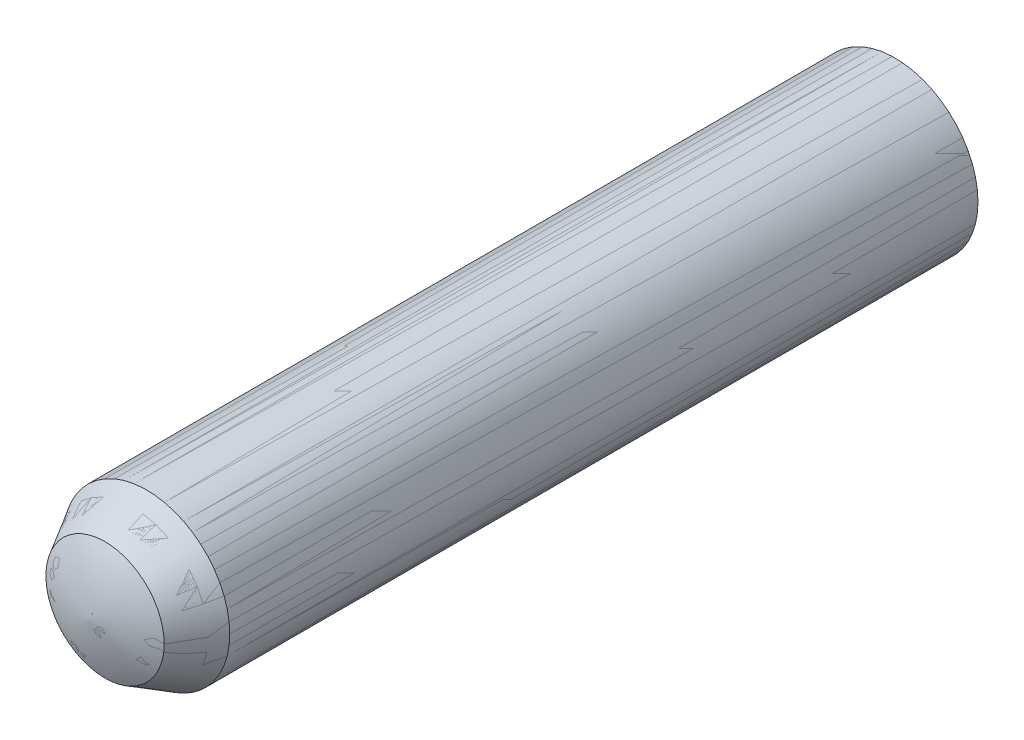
ISO-10303-21;
HEADER;
FILE_DESCRIPTION(('STEP AP214'),'2;1');
FILE_NAME('part.step','',(''),(''),'','','');
FILE_SCHEMA(('AUTOMOTIVE_DESIGN { 1 0 10303 214 1 1 1 1 }'));
ENDSEC;
DATA;
#1=APPLICATION_CONTEXT('core data for automotive mechanical design processes');
#2=APPLICATION_PROTOCOL_DEFINITION('international standard','automotive_design',2000,#1);
#3=PRODUCT_CONTEXT('',#1,'mechanical');
#4=PRODUCT('Part','Part','',(#3));
#5=PRODUCT_RELATED_PRODUCT_CATEGORY('part','',(#4));
#6=PRODUCT_DEFINITION_FORMATION('','',#4);
#7=PRODUCT_DEFINITION_CONTEXT('part definition',#1,'design');
#8=PRODUCT_DEFINITION('design','',#6,#7);
#9=PRODUCT_DEFINITION_SHAPE('','',#8);
#10=(LENGTH_UNIT() NAMED_UNIT(*) SI_UNIT(.MILLI.,.METRE.));
#11=(NAMED_UNIT(*) PLANE_ANGLE_UNIT() SI_UNIT($,.RADIAN.));
#12=(NAMED_UNIT(*) SI_UNIT($,.STERADIAN.) SOLID_ANGLE_UNIT());
#13=UNCERTAINTY_MEASURE_WITH_UNIT(LENGTH_MEASURE(1.E-05),#10,'distance_accuracy_value','');
#14=(GEOMETRIC_REPRESENTATION_CONTEXT(3) GLOBAL_UNCERTAINTY_ASSIGNED_CONTEXT((#13)) GLOBAL_UNIT_ASSIGNED_CONTEXT((#10,
#11,#12)) REPRESENTATION_CONTEXT('',''));
#15=CARTESIAN_POINT('',(0.,0.,0.));
#16=DIRECTION('',(0.,0.,1.));
#17=DIRECTION('',(1.,0.,0.));
#18=AXIS2_PLACEMENT_3D('',#15,#16,#17);
#19=CARTESIAN_POINT('',(-0.109549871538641,-1.30329266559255E-13,3.99849957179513));
#20=DIRECTION('',(0.,-0.999999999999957,0.));
#21=DIRECTION('',(0.99999999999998,0.,0.));
#22=AXIS2_PLACEMENT_3D('',#19,#20,#21);
#23=CIRCLE('',#22,4.);
#24=TRIMMED_CURVE('',#23,(PARAMETER_VALUE(-1.5434054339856)),(PARAMETER_VALUE(1.5434054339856)),
.T.,.PARAMETER.);
#25=CARTESIAN_POINT('',(-1.02348685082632E-13,-1.30104260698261E-13,3.99849957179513));
#26=DIRECTION('',(0.,0.,0.999999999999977));
#27=AXIS1_PLACEMENT('',#25,#26);
#28=SURFACE_OF_REVOLUTION('',#24,#27);
#29=CARTESIAN_POINT('',(-1.00613961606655E-13,-1.30104260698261E-13,0.600000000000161));
#30=DIRECTION('',(0.,0.,0.999999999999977));
#31=DIRECTION('',(0.99999999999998,0.,0.));
#32=AXIS2_PLACEMENT_3D('',#29,#30,#31);
#33=CIRCLE('',#32,2.);
#34=CARTESIAN_POINT('',(1.99999999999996,0.,0.600000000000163));
#35=VERTEX_POINT('',#34);
#36=EDGE_CURVE('P0_E13',#35,#35,#33,.T.);
#37=ORIENTED_EDGE('',*,*,#36,.F.);
#38=EDGE_LOOP('',(#37));
#39=FACE_BOUND('',#38,.T.);
#40=CARTESIAN_POINT('',(0.,0.,1.61329283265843E-13));
#41=VERTEX_POINT('',#40);
#42=VERTEX_LOOP('',#41);
#43=FACE_BOUND('',#42,.T.);
#44=ADVANCED_FACE('P0_F358',(#39,#43),#28,.T.);
#45=CARTESIAN_POINT('',(0.,0.,1.61329283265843E-13));
#46=DIRECTION('',(0.,0.,0.999999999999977));
#47=DIRECTION('',(0.99999999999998,0.,0.));
#48=AXIS2_PLACEMENT_3D('',#45,#46,#47);
#49=CYLINDRICAL_SURFACE('',#48,2.);
#50=CARTESIAN_POINT('',(-1.05818132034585E-13,0.,18.6));
#51=DIRECTION('',(0.,0.,0.999999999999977));
#52=DIRECTION('',(0.99999999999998,0.,0.));
#53=AXIS2_PLACEMENT_3D('',#50,#51,#52);
#54=CIRCLE('',#53,2.);
#55=CARTESIAN_POINT('',(1.99999999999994,0.,18.6));
#56=VERTEX_POINT('',#55);
#57=EDGE_CURVE('P0_E365',#56,#56,#54,.T.);
#58=CARTESIAN_POINT('',(1.99999999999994,0.,18.6));
#59=CARTESIAN_POINT('',(1.99999999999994,0.,18.4125));
#60=CARTESIAN_POINT('',(1.99999999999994,0.,18.225));
#61=CARTESIAN_POINT('',(1.99999999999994,0.,17.85));
#62=CARTESIAN_POINT('',(1.99999999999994,0.,17.6625));
#63=CARTESIAN_POINT('',(1.99999999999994,0.,17.2875));
#64=CARTESIAN_POINT('',(1.99999999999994,0.,17.1));
#65=CARTESIAN_POINT('',(1.99999999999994,0.,16.725));
#66=CARTESIAN_POINT('',(1.99999999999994,0.,16.5375));
#67=CARTESIAN_POINT('',(1.99999999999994,0.,16.1625));
#68=CARTESIAN_POINT('',(1.99999999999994,0.,15.975));
#69=CARTESIAN_POINT('',(1.99999999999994,0.,15.6));
#70=CARTESIAN_POINT('',(1.99999999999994,0.,15.4125));
#71=CARTESIAN_POINT('',(1.99999999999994,0.,15.0375));
#72=CARTESIAN_POINT('',(1.99999999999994,0.,14.85));
#73=CARTESIAN_POINT('',(1.99999999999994,0.,14.475));
#74=CARTESIAN_POINT('',(1.99999999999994,0.,14.2875));
#75=CARTESIAN_POINT('',(1.99999999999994,0.,13.9125));
#76=CARTESIAN_POINT('',(1.99999999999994,0.,13.725));
#77=CARTESIAN_POINT('',(1.99999999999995,0.,13.35));
#78=CARTESIAN_POINT('',(1.99999999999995,0.,13.1625));
#79=CARTESIAN_POINT('',(1.99999999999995,0.,12.7875));
#80=CARTESIAN_POINT('',(1.99999999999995,0.,12.6));
#81=CARTESIAN_POINT('',(1.99999999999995,0.,12.225));
#82=CARTESIAN_POINT('',(1.99999999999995,0.,12.0375));
#83=CARTESIAN_POINT('',(1.99999999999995,0.,11.6625000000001));
#84=CARTESIAN_POINT('',(1.99999999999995,0.,11.4750000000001));
#85=CARTESIAN_POINT('',(1.99999999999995,0.,11.1000000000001));
#86=CARTESIAN_POINT('',(1.99999999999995,0.,10.9125000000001));
#87=CARTESIAN_POINT('',(1.99999999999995,0.,10.5375000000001));
#88=CARTESIAN_POINT('',(1.99999999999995,0.,10.3500000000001));
#89=CARTESIAN_POINT('',(1.99999999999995,0.,9.97500000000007));
#90=CARTESIAN_POINT('',(1.99999999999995,0.,9.78750000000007));
#91=CARTESIAN_POINT('',(1.99999999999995,0.,9.41250000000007));
#92=CARTESIAN_POINT('',(1.99999999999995,0.,9.22500000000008));
#93=CARTESIAN_POINT('',(1.99999999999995,0.,8.85000000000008));
#94=CARTESIAN_POINT('',(1.99999999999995,0.,8.66250000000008));
#95=CARTESIAN_POINT('',(1.99999999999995,0.,8.28750000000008));
#96=CARTESIAN_POINT('',(1.99999999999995,0.,8.10000000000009));
#97=CARTESIAN_POINT('',(1.99999999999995,0.,7.72500000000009));
#98=CARTESIAN_POINT('',(1.99999999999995,0.,7.53750000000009));
#99=CARTESIAN_POINT('',(1.99999999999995,0.,7.1625000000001));
#100=CARTESIAN_POINT('',(1.99999999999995,0.,6.9750000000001));
#101=CARTESIAN_POINT('',(1.99999999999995,0.,6.6000000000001));
#102=CARTESIAN_POINT('',(1.99999999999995,0.,6.41250000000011));
#103=CARTESIAN_POINT('',(1.99999999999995,0.,6.03750000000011));
#104=CARTESIAN_POINT('',(1.99999999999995,0.,5.85000000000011));
#105=CARTESIAN_POINT('',(1.99999999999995,0.,5.47500000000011));
#106=CARTESIAN_POINT('',(1.99999999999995,0.,5.28750000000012));
#107=CARTESIAN_POINT('',(1.99999999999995,0.,4.91250000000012));
#108=CARTESIAN_POINT('',(1.99999999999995,0.,4.72500000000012));
#109=CARTESIAN_POINT('',(1.99999999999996,0.,4.35000000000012));
#110=CARTESIAN_POINT('',(1.99999999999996,0.,4.16250000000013));
#111=CARTESIAN_POINT('',(1.99999999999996,0.,3.78750000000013));
#112=CARTESIAN_POINT('',(1.99999999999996,0.,3.60000000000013));
#113=CARTESIAN_POINT('',(1.99999999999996,0.,3.22500000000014));
#114=CARTESIAN_POINT('',(1.99999999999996,0.,3.03750000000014));
#115=CARTESIAN_POINT('',(1.99999999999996,0.,2.66250000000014));
#116=CARTESIAN_POINT('',(1.99999999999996,0.,2.47500000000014));
#117=CARTESIAN_POINT('',(1.99999999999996,0.,2.10000000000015));
#118=CARTESIAN_POINT('',(1.99999999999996,0.,1.91250000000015));
#119=CARTESIAN_POINT('',(1.99999999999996,0.,1.53750000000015));
#120=CARTESIAN_POINT('',(1.99999999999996,0.,1.35000000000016));
#121=CARTESIAN_POINT('',(1.99999999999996,0.,0.975000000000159));
#122=CARTESIAN_POINT('',(1.99999999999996,0.,0.787500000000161));
#123=CARTESIAN_POINT('',(1.99999999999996,0.,0.600000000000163));
#124=B_SPLINE_CURVE_WITH_KNOTS('',3,(#58,#59,#60,#61,#62,#63,#64,#65,#66,#67,#68,#69,#70,#71,
#72,#73,#74,#75,#76,#77,#78,#79,#80,#81,#82,#83,#84,#85,#86,#87,#88,#89,#90,#91,#92,#93,#94,#95,
#96,#97,#98,#99,#100,#101,#102,#103,#104,#105,#106,#107,#108,#109,#110,#111,#112,#113,#114,#115,
#116,#117,#118,#119,#120,#121,#122,#123),.UNSPECIFIED.,.F.,.F.,(4,2,2,2,2,2,2,2,2,2,2,2,2,2,2,2,
2,2,2,2,2,2,2,2,2,2,2,2,2,2,2,2,4),(0.,0.562499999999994,1.12499999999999,1.68749999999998,
2.24999999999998,2.81249999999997,3.37499999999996,3.93749999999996,4.49999999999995,
5.06249999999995,5.62499999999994,6.18749999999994,6.74999999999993,7.31249999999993,
7.87499999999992,8.43749999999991,8.99999999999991,9.5624999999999,10.1249999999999,
10.6874999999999,11.2499999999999,11.8124999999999,12.3749999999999,12.9374999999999,
13.4999999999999,14.0624999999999,14.6249999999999,15.1874999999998,15.7499999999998,
16.3124999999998,16.8749999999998,17.4374999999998,17.9999999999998),.UNSPECIFIED.);
#125=EDGE_CURVE('P0_BSEAM385',#56,#35,#124,.T.);
#126=ORIENTED_EDGE('',*,*,#57,.F.);
#127=ORIENTED_EDGE('',*,*,#36,.T.);
#128=ORIENTED_EDGE('',*,*,#125,.T.);
#129=ORIENTED_EDGE('',*,*,#125,.F.);
#130=EDGE_LOOP('',(#126,#128,#127,#129));
#131=FACE_BOUND('',#130,.T.);
#132=ADVANCED_FACE('P0_F385',(#131),#49,.T.);
#133=CARTESIAN_POINT('',(-1.05818132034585E-13,0.,18.6));
#134=DIRECTION('',(0.,0.,-0.999999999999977));
#135=DIRECTION('',(-0.99999999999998,0.,0.));
#136=AXIS2_PLACEMENT_3D('',#133,#134,#135);
#137=CONICAL_SURFACE('',#136,2.,0.523598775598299);
#138=CARTESIAN_POINT('',(0.,-1.57859836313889E-13,19.6));
#139=DIRECTION('',(0.,0.,0.999999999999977));
#140=DIRECTION('',(0.99999999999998,0.,0.));
#141=AXIS2_PLACEMENT_3D('',#138,#139,#140);
#142=CIRCLE('',#141,1.42264973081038);
#143=CARTESIAN_POINT('',(1.42264973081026,-1.54937838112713E-13,19.6));
#144=VERTEX_POINT('',#143);
#145=EDGE_CURVE('P0_E378',#144,#144,#142,.T.);
#146=ORIENTED_EDGE('',*,*,#145,.F.);
#147=EDGE_LOOP('',(#146));
#148=FACE_BOUND('',#147,.T.);
#149=ORIENTED_EDGE('',*,*,#57,.T.);
#150=EDGE_LOOP('',(#149));
#151=FACE_BOUND('',#150,.T.);
#152=ADVANCED_FACE('P0_F374',(#148,#151),#137,.T.);
#153=CARTESIAN_POINT('',(-0.352722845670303,0.,16.0155820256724));
#154=DIRECTION('',(0.,-0.999999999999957,0.));
#155=DIRECTION('',(0.99999999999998,0.,0.));
#156=AXIS2_PLACEMENT_3D('',#153,#154,#155);
#157=CIRCLE('',#156,4.);
#158=TRIMMED_CURVE('',#157,(PARAMETER_VALUE(-1.48250093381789)),
(PARAMETER_VALUE(1.48250093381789)),.T.,.PARAMETER.);
#159=CARTESIAN_POINT('',(0.,0.,16.0155820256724));
#160=DIRECTION('',(0.,0.,0.999999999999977));
#161=AXIS1_PLACEMENT('',#159,#160);
#162=SURFACE_OF_REVOLUTION('',#158,#161);
#163=CARTESIAN_POINT('',(0.,-1.6826817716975E-13,19.9999999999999));
#164=VERTEX_POINT('',#163);
#165=VERTEX_LOOP('',#164);
#166=FACE_BOUND('',#165,.T.);
#167=ORIENTED_EDGE('',*,*,#145,.T.);
#168=EDGE_LOOP('',(#167));
#169=FACE_BOUND('',#168,.T.);
#170=ADVANCED_FACE('P0_F371',(#166,#169),#162,.T.);
#171=CLOSED_SHELL('',(#44,#132,#152,#170));
#172=MANIFOLD_SOLID_BREP('P0_B2',#171);
#173=CARTESIAN_POINT('',(-0.109549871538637,-1.05872388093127E-13,3.99849957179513));
#174=DIRECTION('',(0.,-0.99999999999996,0.));
#175=DIRECTION('',(0.99999999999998,0.,0.));
#176=AXIS2_PLACEMENT_3D('',#173,#174,#175);
#177=CIRCLE('',#176,4.);
#178=TRIMMED_CURVE('',#177,(PARAMETER_VALUE(-1.5434054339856)),
(PARAMETER_VALUE(1.5434054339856)),.T.,.PARAMETER.);
#179=CARTESIAN_POINT('',(0.,-1.05818132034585E-13,3.99849957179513));
#180=DIRECTION('',(0.,0.,0.99999999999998));
#181=AXIS1_PLACEMENT('',#179,#180);
#182=SURFACE_OF_REVOLUTION('',#178,#181);
#183=CARTESIAN_POINT('',(0.,-1.05818132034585E-13,0.600000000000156));
#184=DIRECTION('',(0.,0.,0.99999999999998));
#185=DIRECTION('',(0.99999999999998,0.,0.));
#186=AXIS2_PLACEMENT_3D('',#183,#184,#185);
#187=CIRCLE('',#186,2.);
#188=CARTESIAN_POINT('',(1.99999999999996,0.,0.600000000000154));
#189=VERTEX_POINT('',#188);
#190=EDGE_CURVE('P1_E10',#189,#189,#187,.T.);
#191=ORIENTED_EDGE('',*,*,#190,.F.);
#192=EDGE_LOOP('',(#191));
#193=FACE_BOUND('',#192,.T.);
#194=CARTESIAN_POINT('',(0.,0.,1.57859836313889E-13));
#195=VERTEX_POINT('',#194);
#196=VERTEX_LOOP('',#195);
#197=FACE_BOUND('',#196,.T.);
#198=ADVANCED_FACE('P1_F15',(#193,#197),#182,.T.);
#199=CARTESIAN_POINT('',(0.,0.,1.57859836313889E-13));
#200=DIRECTION('',(0.,0.,0.99999999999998));
#201=DIRECTION('',(0.99999999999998,0.,0.));
#202=AXIS2_PLACEMENT_3D('',#199,#200,#201);
#203=CYLINDRICAL_SURFACE('',#202,2.);
#204=CARTESIAN_POINT('',(0.,0.,18.6));
#205=DIRECTION('',(0.,0.,0.99999999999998));
#206=DIRECTION('',(0.99999999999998,0.,0.));
#207=AXIS2_PLACEMENT_3D('',#204,#205,#206);
#208=CIRCLE('',#207,2.);
#209=CARTESIAN_POINT('',(1.99999999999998,0.,18.6));
#210=VERTEX_POINT('',#209);
#211=EDGE_CURVE('P1_E22',#210,#210,#208,.T.);
#212=CARTESIAN_POINT('',(1.99999999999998,0.,18.6));
#213=CARTESIAN_POINT('',(1.99999999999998,0.,18.4125));
#214=CARTESIAN_POINT('',(1.99999999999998,0.,18.225));
#215=CARTESIAN_POINT('',(1.99999999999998,0.,17.85));
#216=CARTESIAN_POINT('',(1.99999999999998,0.,17.6625));
#217=CARTESIAN_POINT('',(1.99999999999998,0.,17.2875));
#218=CARTESIAN_POINT('',(1.99999999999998,0.,17.1));
#219=CARTESIAN_POINT('',(1.99999999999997,0.,16.725));
#220=CARTESIAN_POINT('',(1.99999999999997,0.,16.5375));
#221=CARTESIAN_POINT('',(1.99999999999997,0.,16.1625));
#222=CARTESIAN_POINT('',(1.99999999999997,0.,15.975));
#223=CARTESIAN_POINT('',(1.99999999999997,0.,15.6));
#224=CARTESIAN_POINT('',(1.99999999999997,0.,15.4125));
#225=CARTESIAN_POINT('',(1.99999999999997,0.,15.0375));
#226=CARTESIAN_POINT('',(1.99999999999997,0.,14.85));
#227=CARTESIAN_POINT('',(1.99999999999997,0.,14.475));
#228=CARTESIAN_POINT('',(1.99999999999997,0.,14.2875));
#229=CARTESIAN_POINT('',(1.99999999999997,0.,13.9125));
#230=CARTESIAN_POINT('',(1.99999999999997,0.,13.725));
#231=CARTESIAN_POINT('',(1.99999999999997,0.,13.35));
#232=CARTESIAN_POINT('',(1.99999999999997,0.,13.1625));
#233=CARTESIAN_POINT('',(1.99999999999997,0.,12.7875000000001));
#234=CARTESIAN_POINT('',(1.99999999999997,0.,12.6000000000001));
#235=CARTESIAN_POINT('',(1.99999999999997,0.,12.2250000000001));
#236=CARTESIAN_POINT('',(1.99999999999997,0.,12.0375000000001));
#237=CARTESIAN_POINT('',(1.99999999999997,0.,11.6625000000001));
#238=CARTESIAN_POINT('',(1.99999999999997,0.,11.4750000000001));
#239=CARTESIAN_POINT('',(1.99999999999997,0.,11.1000000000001));
#240=CARTESIAN_POINT('',(1.99999999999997,0.,10.9125000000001));
#241=CARTESIAN_POINT('',(1.99999999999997,0.,10.5375000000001));
#242=CARTESIAN_POINT('',(1.99999999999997,0.,10.3500000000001));
#243=CARTESIAN_POINT('',(1.99999999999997,0.,9.97500000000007));
#244=CARTESIAN_POINT('',(1.99999999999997,0.,9.78750000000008));
#245=CARTESIAN_POINT('',(1.99999999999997,0.,9.41250000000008));
#246=CARTESIAN_POINT('',(1.99999999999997,0.,9.22500000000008));
#247=CARTESIAN_POINT('',(1.99999999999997,0.,8.85000000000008));
#248=CARTESIAN_POINT('',(1.99999999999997,0.,8.66250000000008));
#249=CARTESIAN_POINT('',(1.99999999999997,0.,8.28750000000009));
#250=CARTESIAN_POINT('',(1.99999999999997,0.,8.10000000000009));
#251=CARTESIAN_POINT('',(1.99999999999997,0.,7.72500000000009));
#252=CARTESIAN_POINT('',(1.99999999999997,0.,7.53750000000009));
#253=CARTESIAN_POINT('',(1.99999999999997,0.,7.1625000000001));
#254=CARTESIAN_POINT('',(1.99999999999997,0.,6.9750000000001));
#255=CARTESIAN_POINT('',(1.99999999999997,0.,6.6000000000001));
#256=CARTESIAN_POINT('',(1.99999999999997,0.,6.4125000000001));
#257=CARTESIAN_POINT('',(1.99999999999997,0.,6.03750000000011));
#258=CARTESIAN_POINT('',(1.99999999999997,0.,5.85000000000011));
#259=CARTESIAN_POINT('',(1.99999999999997,0.,5.47500000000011));
#260=CARTESIAN_POINT('',(1.99999999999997,0.,5.28750000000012));
#261=CARTESIAN_POINT('',(1.99999999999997,0.,4.91250000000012));
#262=CARTESIAN_POINT('',(1.99999999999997,0.,4.72500000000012));
#263=CARTESIAN_POINT('',(1.99999999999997,0.,4.35000000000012));
#264=CARTESIAN_POINT('',(1.99999999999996,0.,4.16250000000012));
#265=CARTESIAN_POINT('',(1.99999999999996,0.,3.78750000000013));
#266=CARTESIAN_POINT('',(1.99999999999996,0.,3.60000000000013));
#267=CARTESIAN_POINT('',(1.99999999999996,0.,3.22500000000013));
#268=CARTESIAN_POINT('',(1.99999999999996,0.,3.03750000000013));
#269=CARTESIAN_POINT('',(1.99999999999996,0.,2.66250000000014));
#270=CARTESIAN_POINT('',(1.99999999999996,0.,2.47500000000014));
#271=CARTESIAN_POINT('',(1.99999999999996,0.,2.10000000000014));
#272=CARTESIAN_POINT('',(1.99999999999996,0.,1.91250000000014));
#273=CARTESIAN_POINT('',(1.99999999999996,0.,1.53750000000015));
#274=CARTESIAN_POINT('',(1.99999999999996,0.,1.35000000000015));
#275=CARTESIAN_POINT('',(1.99999999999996,0.,0.975000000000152));
#276=CARTESIAN_POINT('',(1.99999999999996,0.,0.787500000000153));
#277=CARTESIAN_POINT('',(1.99999999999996,0.,0.600000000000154));
#278=B_SPLINE_CURVE_WITH_KNOTS('',3,(#212,#213,#214,#215,#216,#217,#218,#219,#220,#221,#222,
#223,#224,#225,#226,#227,#228,#229,#230,#231,#232,#233,#234,#235,#236,#237,#238,#239,#240,#241,
#242,#243,#244,#245,#246,#247,#248,#249,#250,#251,#252,#253,#254,#255,#256,#257,#258,#259,#260,
#261,#262,#263,#264,#265,#266,#267,#268,#269,#270,#271,#272,#273,#274,#275,#276,#277),
.UNSPECIFIED.,.F.,.F.,(4,2,2,2,2,2,2,2,2,2,2,2,2,2,2,2,2,2,2,2,2,2,2,2,2,2,2,2,2,2,2,2,4),(0.,
0.562499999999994,1.12499999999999,1.68749999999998,2.24999999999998,2.81249999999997,
3.37499999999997,3.93749999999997,4.49999999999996,5.06249999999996,5.62499999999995,
6.18749999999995,6.74999999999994,7.31249999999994,7.87499999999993,8.43749999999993,
8.99999999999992,9.56249999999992,10.1249999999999,10.6874999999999,11.2499999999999,
11.8124999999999,12.3749999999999,12.9374999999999,13.4999999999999,14.0624999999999,
14.6249999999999,15.1874999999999,15.7499999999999,16.3124999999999,16.8749999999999,
17.4374999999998,17.9999999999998),.UNSPECIFIED.);
#279=EDGE_CURVE('P1_BSEAM41',#210,#189,#278,.T.);
#280=ORIENTED_EDGE('',*,*,#211,.F.);
#281=ORIENTED_EDGE('',*,*,#190,.T.);
#282=ORIENTED_EDGE('',*,*,#279,.T.);
#283=ORIENTED_EDGE('',*,*,#279,.F.);
#284=EDGE_LOOP('',(#280,#282,#281,#283));
#285=FACE_BOUND('',#284,.T.);
#286=ADVANCED_FACE('P1_F41',(#285),#203,.T.);
#287=CARTESIAN_POINT('',(0.,0.,18.6));
#288=DIRECTION('',(0.,0.,-0.99999999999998));
#289=DIRECTION('',(-0.99999999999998,0.,0.));
#290=AXIS2_PLACEMENT_3D('',#287,#288,#289);
#291=CONICAL_SURFACE('',#290,2.,0.523598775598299);
#292=CARTESIAN_POINT('',(0.,-1.40512601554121E-13,19.6));
#293=DIRECTION('',(0.,0.,0.99999999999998));
#294=DIRECTION('',(0.99999999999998,0.,0.));
#295=AXIS2_PLACEMENT_3D('',#292,#293,#294);
#296=CIRCLE('',#295,1.42264973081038);
#297=CARTESIAN_POINT('',(1.42264973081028,-1.39808014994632E-13,19.6));
#298=VERTEX_POINT('',#297);
#299=EDGE_CURVE('P1_E34',#298,#298,#296,.T.);
#300=ORIENTED_EDGE('',*,*,#299,.F.);
#301=EDGE_LOOP('',(#300));
#302=FACE_BOUND('',#301,.T.);
#303=ORIENTED_EDGE('',*,*,#211,.T.);
#304=EDGE_LOOP('',(#303));
#305=FACE_BOUND('',#304,.T.);
#306=ADVANCED_FACE('P1_F30',(#302,#305),#291,.T.);
#307=CARTESIAN_POINT('',(-0.352722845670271,0.,16.0155820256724));
#308=DIRECTION('',(0.,-0.99999999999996,0.));
#309=DIRECTION('',(0.99999999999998,0.,0.));
#310=AXIS2_PLACEMENT_3D('',#307,#308,#309);
#311=CIRCLE('',#310,4.);
#312=TRIMMED_CURVE('',#311,(PARAMETER_VALUE(-1.48250093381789)),
(PARAMETER_VALUE(1.48250093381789)),.T.,.PARAMETER.);
#313=CARTESIAN_POINT('',(0.,0.,16.0155820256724));
#314=DIRECTION('',(0.,0.,0.99999999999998));
#315=AXIS1_PLACEMENT('',#313,#314);
#316=SURFACE_OF_REVOLUTION('',#312,#315);
#317=CARTESIAN_POINT('',(0.,-1.43982048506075E-13,20.));
#318=VERTEX_POINT('',#317);
#319=VERTEX_LOOP('',#318);
#320=FACE_BOUND('',#319,.T.);
#321=ORIENTED_EDGE('',*,*,#299,.T.);
#322=EDGE_LOOP('',(#321));
#323=FACE_BOUND('',#322,.T.);
#324=ADVANCED_FACE('P1_F28',(#320,#323),#316,.T.);
#325=CLOSED_SHELL('',(#198,#286,#306,#324));
#326=MANIFOLD_SOLID_BREP('P1_B1',#325);
#327=ADVANCED_BREP_SHAPE_REPRESENTATION('',(#18,#172,#326),#14);
#328=SHAPE_DEFINITION_REPRESENTATION(#9,#327);
ENDSEC;
END-ISO-10303-21;
